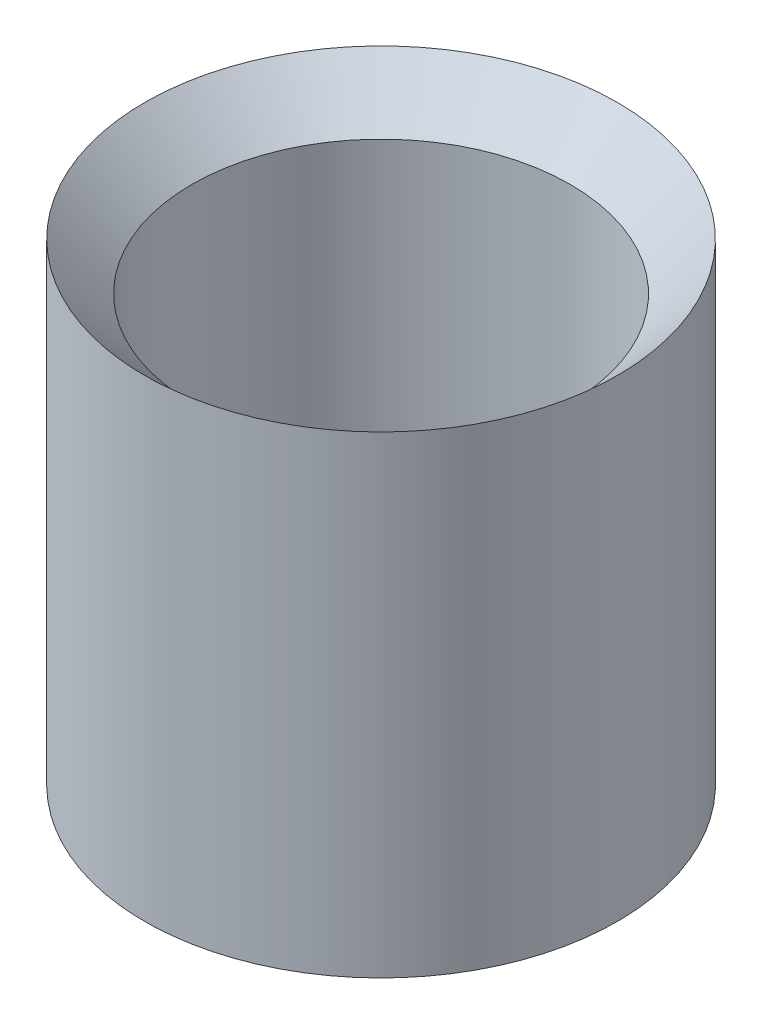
from build123d import *


with BuildPart() as part:
    # Sketch1 → Revolve1 (revolve)
    with BuildSketch(Plane.XY, mode=Mode.PRIVATE) as revolve1_sk:
        Polygon((-50, 0), (-50, 100), (-40, 90), (-40, 0), align=None)
    revolve(revolve1_sk.sketch.rotate(Axis((0, -73.061494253, 0), (0, 1, 0)), 270), axis=Axis((0, -73.061494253, 0), (0, 1, 0)))


solid = part.part
